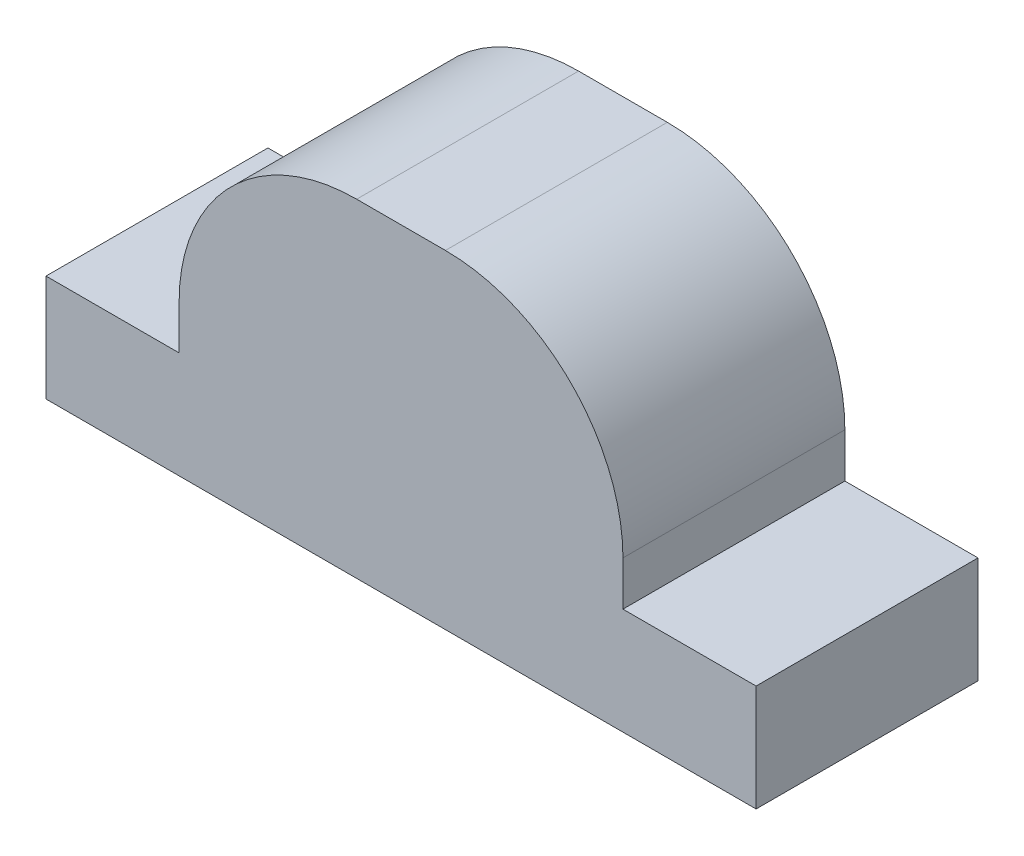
ISO-10303-21;
HEADER;
FILE_DESCRIPTION(('STEP AP214'),'2;1');
FILE_NAME('part.step','',(''),(''),'','','');
FILE_SCHEMA(('AUTOMOTIVE_DESIGN { 1 0 10303 214 1 1 1 1 }'));
ENDSEC;
DATA;
#1=APPLICATION_CONTEXT('core data for automotive mechanical design processes');
#2=APPLICATION_PROTOCOL_DEFINITION('international standard','automotive_design',2000,#1);
#3=PRODUCT_CONTEXT('',#1,'mechanical');
#4=PRODUCT('Part','Part','',(#3));
#5=PRODUCT_RELATED_PRODUCT_CATEGORY('part','',(#4));
#6=PRODUCT_DEFINITION_FORMATION('','',#4);
#7=PRODUCT_DEFINITION_CONTEXT('part definition',#1,'design');
#8=PRODUCT_DEFINITION('design','',#6,#7);
#9=PRODUCT_DEFINITION_SHAPE('','',#8);
#10=(LENGTH_UNIT() NAMED_UNIT(*) SI_UNIT(.MILLI.,.METRE.));
#11=(NAMED_UNIT(*) PLANE_ANGLE_UNIT() SI_UNIT($,.RADIAN.));
#12=(NAMED_UNIT(*) SI_UNIT($,.STERADIAN.) SOLID_ANGLE_UNIT());
#13=UNCERTAINTY_MEASURE_WITH_UNIT(LENGTH_MEASURE(1.E-05),#10,'distance_accuracy_value','');
#14=(GEOMETRIC_REPRESENTATION_CONTEXT(3) GLOBAL_UNCERTAINTY_ASSIGNED_CONTEXT((#13)) GLOBAL_UNIT_ASSIGNED_CONTEXT((#10,
#11,#12)) REPRESENTATION_CONTEXT('',''));
#15=CARTESIAN_POINT('',(0.,0.,0.));
#16=DIRECTION('',(0.,0.,1.));
#17=DIRECTION('',(1.,0.,0.));
#18=AXIS2_PLACEMENT_3D('',#15,#16,#17);
#19=CARTESIAN_POINT('',(-1.,0.68,-2.73606797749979));
#20=DIRECTION('',(-1.,0.,0.));
#21=DIRECTION('',(0.,0.,1.));
#22=AXIS2_PLACEMENT_3D('',#19,#20,#21);
#23=PLANE('',#22);
#24=DIRECTION('',(0.,1.,0.));
#25=VECTOR('',#24,1.);
#26=CARTESIAN_POINT('',(-1.,0.68,-0.5));
#27=LINE('',#26,#25);
#28=CARTESIAN_POINT('',(-1.,0.48,-0.5));
#29=VERTEX_POINT('',#28);
#30=CARTESIAN_POINT('',(-1.,0.68,-0.5));
#31=VERTEX_POINT('',#30);
#32=EDGE_CURVE('E172',#29,#31,#27,.T.);
#33=ORIENTED_EDGE('',*,*,#32,.F.);
#34=DIRECTION('',(0.,0.,1.));
#35=VECTOR('',#34,1.);
#36=CARTESIAN_POINT('',(-1.,0.48,-2.73606797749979));
#37=LINE('',#36,#35);
#38=CARTESIAN_POINT('',(-1.,0.48,0.5));
#39=VERTEX_POINT('',#38);
#40=EDGE_CURVE('E262',#29,#39,#37,.T.);
#41=ORIENTED_EDGE('',*,*,#40,.T.);
#42=DIRECTION('',(0.,-1.,0.));
#43=VECTOR('',#42,1.);
#44=CARTESIAN_POINT('',(-1.,0.68,0.5));
#45=LINE('',#44,#43);
#46=CARTESIAN_POINT('',(-1.,0.68,0.5));
#47=VERTEX_POINT('',#46);
#48=EDGE_CURVE('E188',#47,#39,#45,.T.);
#49=ORIENTED_EDGE('',*,*,#48,.F.);
#50=DIRECTION('',(0.,0.,1.));
#51=VECTOR('',#50,1.);
#52=CARTESIAN_POINT('',(-1.,0.68,-2.73606797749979));
#53=LINE('',#52,#51);
#54=EDGE_CURVE('E38',#31,#47,#53,.T.);
#55=ORIENTED_EDGE('',*,*,#54,.F.);
#56=EDGE_LOOP('',(#33,#41,#49,#55));
#57=FACE_BOUND('',#56,.T.);
#58=ADVANCED_FACE('F17',(#57),#23,.T.);
#59=CARTESIAN_POINT('',(1.,0.68,-2.73606797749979));
#60=DIRECTION('',(1.,0.,0.));
#61=DIRECTION('',(0.,1.,0.));
#62=AXIS2_PLACEMENT_3D('',#59,#60,#61);
#63=PLANE('',#62);
#64=DIRECTION('',(0.,-1.,0.));
#65=VECTOR('',#64,1.);
#66=CARTESIAN_POINT('',(1.,0.68,-0.5));
#67=LINE('',#66,#65);
#68=CARTESIAN_POINT('',(1.,0.68,-0.5));
#69=VERTEX_POINT('',#68);
#70=CARTESIAN_POINT('',(1.,0.48,-0.5));
#71=VERTEX_POINT('',#70);
#72=EDGE_CURVE('E175',#69,#71,#67,.T.);
#73=ORIENTED_EDGE('',*,*,#72,.F.);
#74=DIRECTION('',(0.,0.,1.));
#75=VECTOR('',#74,1.);
#76=CARTESIAN_POINT('',(1.,0.68,-2.73606797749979));
#77=LINE('',#76,#75);
#78=CARTESIAN_POINT('',(1.,0.68,0.5));
#79=VERTEX_POINT('',#78);
#80=EDGE_CURVE('E11',#69,#79,#77,.T.);
#81=ORIENTED_EDGE('',*,*,#80,.T.);
#82=DIRECTION('',(0.,1.,0.));
#83=VECTOR('',#82,1.);
#84=CARTESIAN_POINT('',(1.,0.68,0.5));
#85=LINE('',#84,#83);
#86=CARTESIAN_POINT('',(1.,0.48,0.5));
#87=VERTEX_POINT('',#86);
#88=EDGE_CURVE('E196',#87,#79,#85,.T.);
#89=ORIENTED_EDGE('',*,*,#88,.F.);
#90=DIRECTION('',(0.,0.,1.));
#91=VECTOR('',#90,1.);
#92=CARTESIAN_POINT('',(1.,0.48,-2.73606797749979));
#93=LINE('',#92,#91);
#94=EDGE_CURVE('E191',#71,#87,#93,.T.);
#95=ORIENTED_EDGE('',*,*,#94,.F.);
#96=EDGE_LOOP('',(#73,#81,#89,#95));
#97=FACE_BOUND('',#96,.T.);
#98=ADVANCED_FACE('F237',(#97),#63,.T.);
#99=CARTESIAN_POINT('',(0.2,0.68,-2.73606797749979));
#100=DIRECTION('',(0.,0.,1.));
#101=DIRECTION('',(1.,0.,0.));
#102=AXIS2_PLACEMENT_3D('',#99,#100,#101);
#103=CYLINDRICAL_SURFACE('',#102,0.8);
#104=CARTESIAN_POINT('',(0.2,0.68,-0.5));
#105=DIRECTION('',(0.,0.,-1.));
#106=DIRECTION('',(1.,0.,0.));
#107=AXIS2_PLACEMENT_3D('',#104,#105,#106);
#108=CIRCLE('',#107,0.8);
#109=CARTESIAN_POINT('',(0.2,1.48,-0.5));
#110=VERTEX_POINT('',#109);
#111=EDGE_CURVE('E180',#110,#69,#108,.T.);
#112=ORIENTED_EDGE('',*,*,#111,.F.);
#113=DIRECTION('',(0.,0.,1.));
#114=VECTOR('',#113,1.);
#115=CARTESIAN_POINT('',(0.2,1.48,-2.73606797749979));
#116=LINE('',#115,#114);
#117=CARTESIAN_POINT('',(0.2,1.48,0.5));
#118=VERTEX_POINT('',#117);
#119=EDGE_CURVE('E25',#110,#118,#116,.T.);
#120=ORIENTED_EDGE('',*,*,#119,.T.);
#121=CARTESIAN_POINT('',(0.2,0.68,0.5));
#122=DIRECTION('',(0.,0.,1.));
#123=DIRECTION('',(-1.,0.,0.));
#124=AXIS2_PLACEMENT_3D('',#121,#122,#123);
#125=CIRCLE('',#124,0.8);
#126=EDGE_CURVE('E200',#79,#118,#125,.T.);
#127=ORIENTED_EDGE('',*,*,#126,.F.);
#128=ORIENTED_EDGE('',*,*,#80,.F.);
#129=EDGE_LOOP('',(#112,#120,#127,#128));
#130=FACE_BOUND('',#129,.T.);
#131=ADVANCED_FACE('F232',(#130),#103,.T.);
#132=CARTESIAN_POINT('',(0.2,1.48,-2.73606797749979));
#133=DIRECTION('',(0.,1.,0.));
#134=DIRECTION('',(1.,0.,0.));
#135=AXIS2_PLACEMENT_3D('',#132,#133,#134);
#136=PLANE('',#135);
#137=DIRECTION('',(1.,0.,0.));
#138=VECTOR('',#137,1.);
#139=CARTESIAN_POINT('',(0.2,1.48,-0.5));
#140=LINE('',#139,#138);
#141=CARTESIAN_POINT('',(-0.2,1.48,-0.5));
#142=VERTEX_POINT('',#141);
#143=EDGE_CURVE('E184',#142,#110,#140,.T.);
#144=ORIENTED_EDGE('',*,*,#143,.F.);
#145=DIRECTION('',(0.,0.,1.));
#146=VECTOR('',#145,1.);
#147=CARTESIAN_POINT('',(-0.2,1.48,-2.73606797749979));
#148=LINE('',#147,#146);
#149=CARTESIAN_POINT('',(-0.2,1.48,0.5));
#150=VERTEX_POINT('',#149);
#151=EDGE_CURVE('E49',#142,#150,#148,.T.);
#152=ORIENTED_EDGE('',*,*,#151,.T.);
#153=DIRECTION('',(-1.,0.,0.));
#154=VECTOR('',#153,1.);
#155=CARTESIAN_POINT('',(0.2,1.48,0.5));
#156=LINE('',#155,#154);
#157=EDGE_CURVE('E207',#118,#150,#156,.T.);
#158=ORIENTED_EDGE('',*,*,#157,.F.);
#159=ORIENTED_EDGE('',*,*,#119,.F.);
#160=EDGE_LOOP('',(#144,#152,#158,#159));
#161=FACE_BOUND('',#160,.T.);
#162=ADVANCED_FACE('F233',(#161),#136,.T.);
#163=CARTESIAN_POINT('',(-0.2,0.68,-2.73606797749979));
#164=DIRECTION('',(0.,0.,1.));
#165=DIRECTION('',(1.,0.,0.));
#166=AXIS2_PLACEMENT_3D('',#163,#164,#165);
#167=CYLINDRICAL_SURFACE('',#166,0.8);
#168=CARTESIAN_POINT('',(-0.2,0.68,-0.5));
#169=DIRECTION('',(0.,0.,-1.));
#170=DIRECTION('',(1.,0.,0.));
#171=AXIS2_PLACEMENT_3D('',#168,#169,#170);
#172=CIRCLE('',#171,0.8);
#173=EDGE_CURVE('E166',#31,#142,#172,.T.);
#174=ORIENTED_EDGE('',*,*,#173,.F.);
#175=ORIENTED_EDGE('',*,*,#54,.T.);
#176=CARTESIAN_POINT('',(-0.2,0.68,0.5));
#177=DIRECTION('',(0.,0.,1.));
#178=DIRECTION('',(1.,0.,0.));
#179=AXIS2_PLACEMENT_3D('',#176,#177,#178);
#180=CIRCLE('',#179,0.8);
#181=EDGE_CURVE('E192',#150,#47,#180,.T.);
#182=ORIENTED_EDGE('',*,*,#181,.F.);
#183=ORIENTED_EDGE('',*,*,#151,.F.);
#184=EDGE_LOOP('',(#174,#175,#182,#183));
#185=FACE_BOUND('',#184,.T.);
#186=ADVANCED_FACE('F281',(#185),#167,.T.);
#187=CARTESIAN_POINT('',(0.,0.,0.));
#188=DIRECTION('',(0.,-1.,0.));
#189=DIRECTION('',(0.,0.,-1.));
#190=AXIS2_PLACEMENT_3D('',#187,#188,#189);
#191=PLANE('',#190);
#192=DIRECTION('',(0.,0.,-1.));
#193=VECTOR('',#192,1.);
#194=CARTESIAN_POINT('',(1.6,0.,0.5));
#195=LINE('',#194,#193);
#196=CARTESIAN_POINT('',(1.6,0.,0.5));
#197=VERTEX_POINT('',#196);
#198=CARTESIAN_POINT('',(1.6,0.,-0.5));
#199=VERTEX_POINT('',#198);
#200=EDGE_CURVE('E141',#197,#199,#195,.T.);
#201=ORIENTED_EDGE('',*,*,#200,.F.);
#202=DIRECTION('',(1.,0.,0.));
#203=VECTOR('',#202,1.);
#204=CARTESIAN_POINT('',(-1.6,0.,0.5));
#205=LINE('',#204,#203);
#206=CARTESIAN_POINT('',(-1.6,0.,0.5));
#207=VERTEX_POINT('',#206);
#208=EDGE_CURVE('E123',#207,#197,#205,.T.);
#209=ORIENTED_EDGE('',*,*,#208,.F.);
#210=DIRECTION('',(0.,0.,1.));
#211=VECTOR('',#210,1.);
#212=CARTESIAN_POINT('',(-1.6,0.,0.5));
#213=LINE('',#212,#211);
#214=CARTESIAN_POINT('',(-1.6,0.,-0.5));
#215=VERTEX_POINT('',#214);
#216=EDGE_CURVE('E204',#215,#207,#213,.T.);
#217=ORIENTED_EDGE('',*,*,#216,.F.);
#218=DIRECTION('',(-1.,0.,0.));
#219=VECTOR('',#218,1.);
#220=CARTESIAN_POINT('',(-1.6,0.,-0.5));
#221=LINE('',#220,#219);
#222=EDGE_CURVE('E145',#199,#215,#221,.T.);
#223=ORIENTED_EDGE('',*,*,#222,.F.);
#224=EDGE_LOOP('',(#201,#209,#217,#223));
#225=FACE_BOUND('',#224,.T.);
#226=ADVANCED_FACE('F147',(#225),#191,.T.);
#227=CARTESIAN_POINT('',(0.,0.48,0.));
#228=DIRECTION('',(0.,-1.,0.));
#229=DIRECTION('',(0.,0.,-1.));
#230=AXIS2_PLACEMENT_3D('',#227,#228,#229);
#231=PLANE('',#230);
#232=DIRECTION('',(-1.,0.,0.));
#233=VECTOR('',#232,1.);
#234=CARTESIAN_POINT('',(-1.6,0.48,-0.5));
#235=LINE('',#234,#233);
#236=CARTESIAN_POINT('',(1.6,0.48,-0.5));
#237=VERTEX_POINT('',#236);
#238=EDGE_CURVE('E179',#237,#71,#235,.T.);
#239=ORIENTED_EDGE('',*,*,#238,.T.);
#240=ORIENTED_EDGE('',*,*,#94,.T.);
#241=DIRECTION('',(1.,0.,0.));
#242=VECTOR('',#241,1.);
#243=CARTESIAN_POINT('',(-1.6,0.48,0.5));
#244=LINE('',#243,#242);
#245=CARTESIAN_POINT('',(1.6,0.48,0.5));
#246=VERTEX_POINT('',#245);
#247=EDGE_CURVE('E135',#87,#246,#244,.T.);
#248=ORIENTED_EDGE('',*,*,#247,.T.);
#249=DIRECTION('',(0.,0.,-1.));
#250=VECTOR('',#249,1.);
#251=CARTESIAN_POINT('',(1.6,0.48,0.5));
#252=LINE('',#251,#250);
#253=EDGE_CURVE('E143',#246,#237,#252,.T.);
#254=ORIENTED_EDGE('',*,*,#253,.T.);
#255=EDGE_LOOP('',(#239,#240,#248,#254));
#256=FACE_BOUND('',#255,.T.);
#257=ADVANCED_FACE('F289',(#256),#231,.F.);
#258=CARTESIAN_POINT('',(-1.6,0.48,0.5));
#259=DIRECTION('',(0.,0.,-1.));
#260=DIRECTION('',(0.,-1.,0.));
#261=AXIS2_PLACEMENT_3D('',#258,#259,#260);
#262=PLANE('',#261);
#263=ORIENTED_EDGE('',*,*,#208,.T.);
#264=DIRECTION('',(0.,-1.,0.));
#265=VECTOR('',#264,1.);
#266=CARTESIAN_POINT('',(1.6,0.48,0.5));
#267=LINE('',#266,#265);
#268=EDGE_CURVE('E127',#246,#197,#267,.T.);
#269=ORIENTED_EDGE('',*,*,#268,.F.);
#270=ORIENTED_EDGE('',*,*,#247,.F.);
#271=ORIENTED_EDGE('',*,*,#88,.T.);
#272=ORIENTED_EDGE('',*,*,#126,.T.);
#273=ORIENTED_EDGE('',*,*,#157,.T.);
#274=ORIENTED_EDGE('',*,*,#181,.T.);
#275=ORIENTED_EDGE('',*,*,#48,.T.);
#276=DIRECTION('',(1.,0.,0.));
#277=VECTOR('',#276,1.);
#278=CARTESIAN_POINT('',(-1.6,0.48,0.5));
#279=LINE('',#278,#277);
#280=CARTESIAN_POINT('',(-1.6,0.48,0.5));
#281=VERTEX_POINT('',#280);
#282=EDGE_CURVE('E152',#281,#39,#279,.T.);
#283=ORIENTED_EDGE('',*,*,#282,.F.);
#284=DIRECTION('',(0.,-1.,0.));
#285=VECTOR('',#284,1.);
#286=CARTESIAN_POINT('',(-1.6,0.48,0.5));
#287=LINE('',#286,#285);
#288=EDGE_CURVE('E130',#281,#207,#287,.T.);
#289=ORIENTED_EDGE('',*,*,#288,.T.);
#290=EDGE_LOOP('',(#263,#269,#270,#271,#272,#273,#274,#275,#283,#289));
#291=FACE_BOUND('',#290,.T.);
#292=ADVANCED_FACE('F125',(#291),#262,.F.);
#293=CARTESIAN_POINT('',(-1.6,0.48,0.5));
#294=DIRECTION('',(1.,0.,0.));
#295=DIRECTION('',(0.,1.,0.));
#296=AXIS2_PLACEMENT_3D('',#293,#294,#295);
#297=PLANE('',#296);
#298=ORIENTED_EDGE('',*,*,#216,.T.);
#299=ORIENTED_EDGE('',*,*,#288,.F.);
#300=DIRECTION('',(0.,0.,1.));
#301=VECTOR('',#300,1.);
#302=CARTESIAN_POINT('',(-1.6,0.48,0.5));
#303=LINE('',#302,#301);
#304=CARTESIAN_POINT('',(-1.6,0.48,-0.5));
#305=VERTEX_POINT('',#304);
#306=EDGE_CURVE('E162',#305,#281,#303,.T.);
#307=ORIENTED_EDGE('',*,*,#306,.F.);
#308=DIRECTION('',(0.,-1.,0.));
#309=VECTOR('',#308,1.);
#310=CARTESIAN_POINT('',(-1.6,0.48,-0.5));
#311=LINE('',#310,#309);
#312=EDGE_CURVE('E168',#305,#215,#311,.T.);
#313=ORIENTED_EDGE('',*,*,#312,.T.);
#314=EDGE_LOOP('',(#298,#299,#307,#313));
#315=FACE_BOUND('',#314,.T.);
#316=ADVANCED_FACE('F304',(#315),#297,.F.);
#317=CARTESIAN_POINT('',(-1.6,0.48,-0.5));
#318=DIRECTION('',(0.,0.,1.));
#319=DIRECTION('',(1.,0.,0.));
#320=AXIS2_PLACEMENT_3D('',#317,#318,#319);
#321=PLANE('',#320);
#322=ORIENTED_EDGE('',*,*,#222,.T.);
#323=ORIENTED_EDGE('',*,*,#312,.F.);
#324=DIRECTION('',(-1.,0.,0.));
#325=VECTOR('',#324,1.);
#326=CARTESIAN_POINT('',(-1.6,0.48,-0.5));
#327=LINE('',#326,#325);
#328=EDGE_CURVE('E256',#29,#305,#327,.T.);
#329=ORIENTED_EDGE('',*,*,#328,.F.);
#330=ORIENTED_EDGE('',*,*,#32,.T.);
#331=ORIENTED_EDGE('',*,*,#173,.T.);
#332=ORIENTED_EDGE('',*,*,#143,.T.);
#333=ORIENTED_EDGE('',*,*,#111,.T.);
#334=ORIENTED_EDGE('',*,*,#72,.T.);
#335=ORIENTED_EDGE('',*,*,#238,.F.);
#336=DIRECTION('',(0.,-1.,0.));
#337=VECTOR('',#336,1.);
#338=CARTESIAN_POINT('',(1.6,0.48,-0.5));
#339=LINE('',#338,#337);
#340=EDGE_CURVE('E151',#237,#199,#339,.T.);
#341=ORIENTED_EDGE('',*,*,#340,.T.);
#342=EDGE_LOOP('',(#322,#323,#329,#330,#331,#332,#333,#334,#335,#341));
#343=FACE_BOUND('',#342,.T.);
#344=ADVANCED_FACE('F239',(#343),#321,.F.);
#345=CARTESIAN_POINT('',(1.6,0.48,0.5));
#346=DIRECTION('',(-1.,0.,0.));
#347=DIRECTION('',(0.,0.,1.));
#348=AXIS2_PLACEMENT_3D('',#345,#346,#347);
#349=PLANE('',#348);
#350=ORIENTED_EDGE('',*,*,#200,.T.);
#351=ORIENTED_EDGE('',*,*,#340,.F.);
#352=ORIENTED_EDGE('',*,*,#253,.F.);
#353=ORIENTED_EDGE('',*,*,#268,.T.);
#354=EDGE_LOOP('',(#350,#351,#352,#353));
#355=FACE_BOUND('',#354,.T.);
#356=ADVANCED_FACE('F139',(#355),#349,.F.);
#357=CARTESIAN_POINT('',(0.,0.48,0.));
#358=DIRECTION('',(0.,-1.,0.));
#359=DIRECTION('',(0.,0.,-1.));
#360=AXIS2_PLACEMENT_3D('',#357,#358,#359);
#361=PLANE('',#360);
#362=ORIENTED_EDGE('',*,*,#40,.F.);
#363=ORIENTED_EDGE('',*,*,#328,.T.);
#364=ORIENTED_EDGE('',*,*,#306,.T.);
#365=ORIENTED_EDGE('',*,*,#282,.T.);
#366=EDGE_LOOP('',(#362,#363,#364,#365));
#367=FACE_BOUND('',#366,.T.);
#368=ADVANCED_FACE('F279',(#367),#361,.F.);
#369=CLOSED_SHELL('',(#58,#98,#131,#162,#186,#226,#257,#292,#316,#344,#356,#368));
#370=MANIFOLD_SOLID_BREP('B1',#369);
#371=ADVANCED_BREP_SHAPE_REPRESENTATION('',(#18,#370),#14);
#372=SHAPE_DEFINITION_REPRESENTATION(#9,#371);
ENDSEC;
END-ISO-10303-21;
